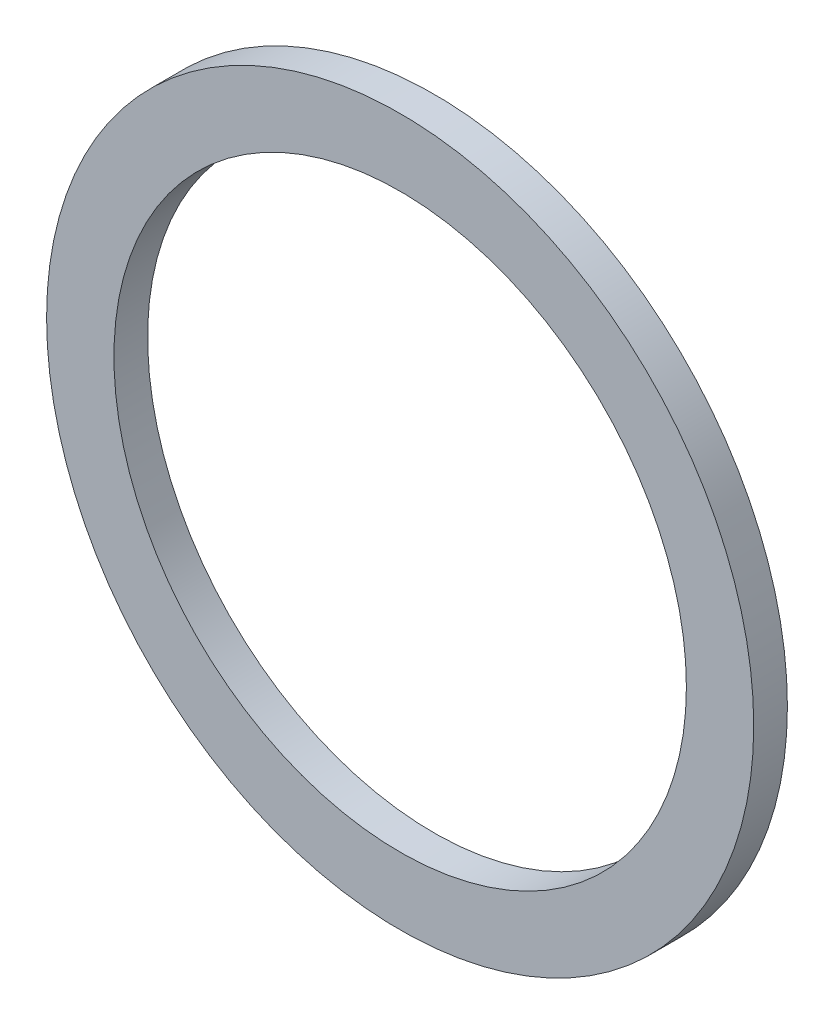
ISO-10303-21;
HEADER;
FILE_DESCRIPTION(('STEP AP214'),'2;1');
FILE_NAME('part.step','',(''),(''),'','','');
FILE_SCHEMA(('AUTOMOTIVE_DESIGN { 1 0 10303 214 1 1 1 1 }'));
ENDSEC;
DATA;
#1=APPLICATION_CONTEXT('core data for automotive mechanical design processes');
#2=APPLICATION_PROTOCOL_DEFINITION('international standard','automotive_design',2000,#1);
#3=PRODUCT_CONTEXT('',#1,'mechanical');
#4=PRODUCT('Part','Part','',(#3));
#5=PRODUCT_RELATED_PRODUCT_CATEGORY('part','',(#4));
#6=PRODUCT_DEFINITION_FORMATION('','',#4);
#7=PRODUCT_DEFINITION_CONTEXT('part definition',#1,'design');
#8=PRODUCT_DEFINITION('design','',#6,#7);
#9=PRODUCT_DEFINITION_SHAPE('','',#8);
#10=(LENGTH_UNIT() NAMED_UNIT(*) SI_UNIT(.MILLI.,.METRE.));
#11=(NAMED_UNIT(*) PLANE_ANGLE_UNIT() SI_UNIT($,.RADIAN.));
#12=(NAMED_UNIT(*) SI_UNIT($,.STERADIAN.) SOLID_ANGLE_UNIT());
#13=UNCERTAINTY_MEASURE_WITH_UNIT(LENGTH_MEASURE(1.E-05),#10,'distance_accuracy_value','');
#14=(GEOMETRIC_REPRESENTATION_CONTEXT(3) GLOBAL_UNCERTAINTY_ASSIGNED_CONTEXT((#13)) GLOBAL_UNIT_ASSIGNED_CONTEXT((#10,
#11,#12)) REPRESENTATION_CONTEXT('',''));
#15=CARTESIAN_POINT('',(0.,0.,0.));
#16=DIRECTION('',(0.,0.,1.));
#17=DIRECTION('',(1.,0.,0.));
#18=AXIS2_PLACEMENT_3D('',#15,#16,#17);
#19=CARTESIAN_POINT('',(0.,0.,1.));
#20=DIRECTION('',(0.,0.,1.));
#21=DIRECTION('',(1.,0.,0.));
#22=AXIS2_PLACEMENT_3D('',#19,#20,#21);
#23=PLANE('',#22);
#24=CARTESIAN_POINT('',(0.,0.,1.));
#25=DIRECTION('',(0.,0.,1.));
#26=DIRECTION('',(1.,0.,0.));
#27=AXIS2_PLACEMENT_3D('',#24,#25,#26);
#28=CIRCLE('',#27,10.5);
#29=CARTESIAN_POINT('',(10.5,0.,1.));
#30=VERTEX_POINT('',#29);
#31=EDGE_CURVE('E10',#30,#30,#28,.T.);
#32=ORIENTED_EDGE('',*,*,#31,.T.);
#33=EDGE_LOOP('',(#32));
#34=FACE_BOUND('',#33,.T.);
#35=CARTESIAN_POINT('',(0.,0.,1.));
#36=DIRECTION('',(0.,0.,1.));
#37=DIRECTION('',(1.,0.,0.));
#38=AXIS2_PLACEMENT_3D('',#35,#36,#37);
#39=CIRCLE('',#38,8.5);
#40=CARTESIAN_POINT('',(8.5,0.,1.));
#41=VERTEX_POINT('',#40);
#42=EDGE_CURVE('E41',#41,#41,#39,.T.);
#43=ORIENTED_EDGE('',*,*,#42,.F.);
#44=EDGE_LOOP('',(#43));
#45=FACE_BOUND('',#44,.T.);
#46=ADVANCED_FACE('F30',(#34,#45),#23,.T.);
#47=CARTESIAN_POINT('',(0.,0.,0.));
#48=DIRECTION('',(0.,0.,1.));
#49=DIRECTION('',(1.,0.,0.));
#50=AXIS2_PLACEMENT_3D('',#47,#48,#49);
#51=PLANE('',#50);
#52=CARTESIAN_POINT('',(0.,0.,0.));
#53=DIRECTION('',(0.,0.,1.));
#54=DIRECTION('',(1.,0.,0.));
#55=AXIS2_PLACEMENT_3D('',#52,#53,#54);
#56=CIRCLE('',#55,10.5);
#57=CARTESIAN_POINT('',(10.5,0.,0.));
#58=VERTEX_POINT('',#57);
#59=EDGE_CURVE('E34',#58,#58,#56,.T.);
#60=ORIENTED_EDGE('',*,*,#59,.F.);
#61=EDGE_LOOP('',(#60));
#62=FACE_BOUND('',#61,.T.);
#63=CARTESIAN_POINT('',(0.,0.,0.));
#64=DIRECTION('',(0.,0.,1.));
#65=DIRECTION('',(1.,0.,0.));
#66=AXIS2_PLACEMENT_3D('',#63,#64,#65);
#67=CIRCLE('',#66,8.5);
#68=CARTESIAN_POINT('',(8.5,0.,0.));
#69=VERTEX_POINT('',#68);
#70=EDGE_CURVE('E43',#69,#69,#67,.T.);
#71=ORIENTED_EDGE('',*,*,#70,.T.);
#72=EDGE_LOOP('',(#71));
#73=FACE_BOUND('',#72,.T.);
#74=ADVANCED_FACE('F53',(#62,#73),#51,.F.);
#75=CARTESIAN_POINT('',(0.,0.,1.));
#76=DIRECTION('',(0.,0.,-1.));
#77=DIRECTION('',(-1.,0.,0.));
#78=AXIS2_PLACEMENT_3D('',#75,#76,#77);
#79=CYLINDRICAL_SURFACE('',#78,10.5);
#80=ORIENTED_EDGE('',*,*,#31,.F.);
#81=EDGE_LOOP('',(#80));
#82=FACE_BOUND('',#81,.T.);
#83=ORIENTED_EDGE('',*,*,#59,.T.);
#84=EDGE_LOOP('',(#83));
#85=FACE_BOUND('',#84,.T.);
#86=ADVANCED_FACE('F32',(#82,#85),#79,.T.);
#87=CARTESIAN_POINT('',(0.,0.,1.));
#88=DIRECTION('',(0.,0.,-1.));
#89=DIRECTION('',(-1.,0.,0.));
#90=AXIS2_PLACEMENT_3D('',#87,#88,#89);
#91=CYLINDRICAL_SURFACE('',#90,8.5);
#92=ORIENTED_EDGE('',*,*,#42,.T.);
#93=EDGE_LOOP('',(#92));
#94=FACE_BOUND('',#93,.T.);
#95=ORIENTED_EDGE('',*,*,#70,.F.);
#96=EDGE_LOOP('',(#95));
#97=FACE_BOUND('',#96,.T.);
#98=ADVANCED_FACE('F49',(#94,#97),#91,.F.);
#99=CLOSED_SHELL('',(#46,#74,#86,#98));
#100=MANIFOLD_SOLID_BREP('B2',#99);
#101=ADVANCED_BREP_SHAPE_REPRESENTATION('',(#18,#100),#14);
#102=SHAPE_DEFINITION_REPRESENTATION(#9,#101);
ENDSEC;
END-ISO-10303-21;
